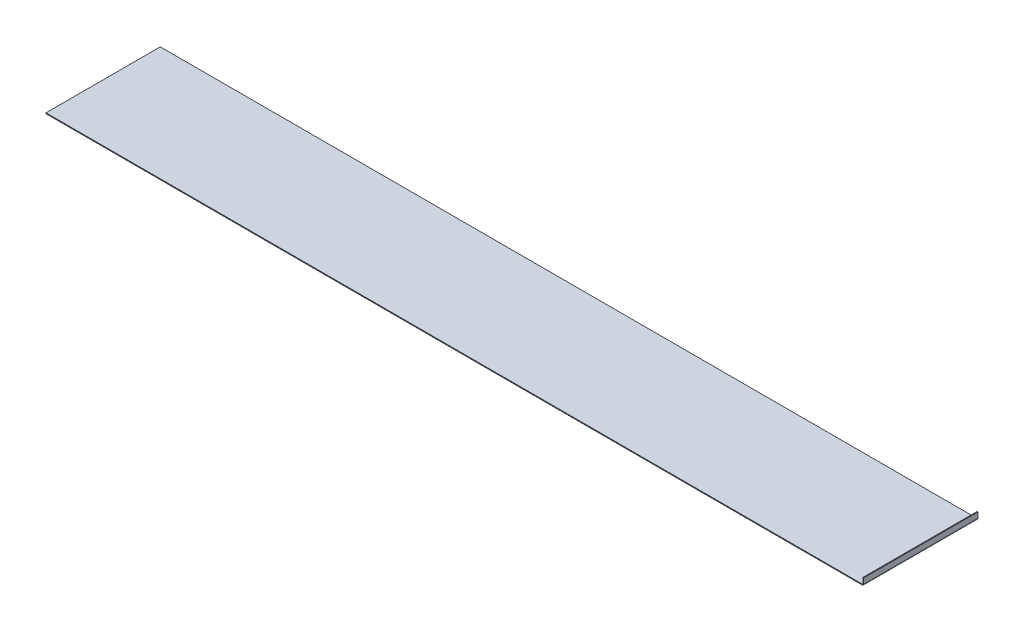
ISO-10303-21;
HEADER;
FILE_DESCRIPTION(('STEP AP214'),'2;1');
FILE_NAME('part.step','',(''),(''),'','','');
FILE_SCHEMA(('AUTOMOTIVE_DESIGN { 1 0 10303 214 1 1 1 1 }'));
ENDSEC;
DATA;
#1=APPLICATION_CONTEXT('core data for automotive mechanical design processes');
#2=APPLICATION_PROTOCOL_DEFINITION('international standard','automotive_design',2000,#1);
#3=PRODUCT_CONTEXT('',#1,'mechanical');
#4=PRODUCT('Part','Part','',(#3));
#5=PRODUCT_RELATED_PRODUCT_CATEGORY('part','',(#4));
#6=PRODUCT_DEFINITION_FORMATION('','',#4);
#7=PRODUCT_DEFINITION_CONTEXT('part definition',#1,'design');
#8=PRODUCT_DEFINITION('design','',#6,#7);
#9=PRODUCT_DEFINITION_SHAPE('','',#8);
#10=(LENGTH_UNIT() NAMED_UNIT(*) SI_UNIT(.MILLI.,.METRE.));
#11=(NAMED_UNIT(*) PLANE_ANGLE_UNIT() SI_UNIT($,.RADIAN.));
#12=(NAMED_UNIT(*) SI_UNIT($,.STERADIAN.) SOLID_ANGLE_UNIT());
#13=UNCERTAINTY_MEASURE_WITH_UNIT(LENGTH_MEASURE(1.E-05),#10,'distance_accuracy_value','');
#14=(GEOMETRIC_REPRESENTATION_CONTEXT(3) GLOBAL_UNCERTAINTY_ASSIGNED_CONTEXT((#13)) GLOBAL_UNIT_ASSIGNED_CONTEXT((#10,
#11,#12)) REPRESENTATION_CONTEXT('',''));
#15=CARTESIAN_POINT('',(0.,0.,0.));
#16=DIRECTION('',(0.,0.,1.));
#17=DIRECTION('',(1.,0.,0.));
#18=AXIS2_PLACEMENT_3D('',#15,#16,#17);
#19=CARTESIAN_POINT('',(-1000.,2.,-140.));
#20=DIRECTION('',(-1.,0.,0.));
#21=DIRECTION('',(0.,0.,1.));
#22=AXIS2_PLACEMENT_3D('',#19,#20,#21);
#23=PLANE('',#22);
#24=DIRECTION('',(0.,1.,0.));
#25=VECTOR('',#24,1.);
#26=CARTESIAN_POINT('',(-1000.,2.,-140.));
#27=LINE('',#26,#25);
#28=CARTESIAN_POINT('',(-1000.,0.,-140.));
#29=VERTEX_POINT('',#28);
#30=CARTESIAN_POINT('',(-1000.,2.,-140.));
#31=VERTEX_POINT('',#30);
#32=EDGE_CURVE('E13',#29,#31,#27,.T.);
#33=ORIENTED_EDGE('',*,*,#32,.F.);
#34=DIRECTION('',(0.,0.,1.));
#35=VECTOR('',#34,1.);
#36=CARTESIAN_POINT('',(-1000.,0.,140.));
#37=LINE('',#36,#35);
#38=CARTESIAN_POINT('',(-1000.,0.,140.));
#39=VERTEX_POINT('',#38);
#40=EDGE_CURVE('E132',#29,#39,#37,.T.);
#41=ORIENTED_EDGE('',*,*,#40,.T.);
#42=DIRECTION('',(0.,1.,0.));
#43=VECTOR('',#42,1.);
#44=CARTESIAN_POINT('',(-1000.,2.,140.));
#45=LINE('',#44,#43);
#46=CARTESIAN_POINT('',(-1000.,2.,140.));
#47=VERTEX_POINT('',#46);
#48=EDGE_CURVE('E64',#39,#47,#45,.T.);
#49=ORIENTED_EDGE('',*,*,#48,.T.);
#50=DIRECTION('',(0.,0.,1.));
#51=VECTOR('',#50,1.);
#52=CARTESIAN_POINT('',(-1000.,2.,-140.));
#53=LINE('',#52,#51);
#54=EDGE_CURVE('E117',#31,#47,#53,.T.);
#55=ORIENTED_EDGE('',*,*,#54,.F.);
#56=EDGE_LOOP('',(#33,#41,#49,#55));
#57=FACE_BOUND('',#56,.T.);
#58=ADVANCED_FACE('F54',(#57),#23,.T.);
#59=CARTESIAN_POINT('',(-1000.,2.,140.));
#60=DIRECTION('',(0.,0.,1.));
#61=DIRECTION('',(1.,0.,0.));
#62=AXIS2_PLACEMENT_3D('',#59,#60,#61);
#63=PLANE('',#62);
#64=ORIENTED_EDGE('',*,*,#48,.F.);
#65=DIRECTION('',(1.,0.,0.));
#66=VECTOR('',#65,1.);
#67=CARTESIAN_POINT('',(1000.,0.,140.));
#68=LINE('',#67,#66);
#69=CARTESIAN_POINT('',(1000.,0.,140.));
#70=VERTEX_POINT('',#69);
#71=EDGE_CURVE('E130',#39,#70,#68,.T.);
#72=ORIENTED_EDGE('',*,*,#71,.T.);
#73=DIRECTION('',(0.,1.,0.));
#74=VECTOR('',#73,1.);
#75=CARTESIAN_POINT('',(1000.,2.,140.));
#76=LINE('',#75,#74);
#77=CARTESIAN_POINT('',(1000.,2.,140.));
#78=VERTEX_POINT('',#77);
#79=EDGE_CURVE('E72',#70,#78,#76,.T.);
#80=ORIENTED_EDGE('',*,*,#79,.T.);
#81=DIRECTION('',(1.,0.,0.));
#82=VECTOR('',#81,1.);
#83=CARTESIAN_POINT('',(-1000.,2.,140.));
#84=LINE('',#83,#82);
#85=EDGE_CURVE('E121',#47,#78,#84,.T.);
#86=ORIENTED_EDGE('',*,*,#85,.F.);
#87=EDGE_LOOP('',(#64,#72,#80,#86));
#88=FACE_BOUND('',#87,.T.);
#89=ADVANCED_FACE('F222',(#88),#63,.T.);
#90=CARTESIAN_POINT('',(-1000.,2.,-140.));
#91=DIRECTION('',(0.,0.,-1.));
#92=DIRECTION('',(-1.,0.,0.));
#93=AXIS2_PLACEMENT_3D('',#90,#91,#92);
#94=PLANE('',#93);
#95=DIRECTION('',(1.,0.,0.));
#96=VECTOR('',#95,1.);
#97=CARTESIAN_POINT('',(1000.,0.,-140.));
#98=LINE('',#97,#96);
#99=CARTESIAN_POINT('',(1000.,0.,-140.));
#100=VERTEX_POINT('',#99);
#101=EDGE_CURVE('E95',#100,#29,#98,.F.);
#102=ORIENTED_EDGE('',*,*,#101,.T.);
#103=ORIENTED_EDGE('',*,*,#32,.T.);
#104=DIRECTION('',(-1.,0.,0.));
#105=VECTOR('',#104,1.);
#106=CARTESIAN_POINT('',(-1000.,2.,-140.));
#107=LINE('',#106,#105);
#108=CARTESIAN_POINT('',(1000.,2.,-140.));
#109=VERTEX_POINT('',#108);
#110=EDGE_CURVE('E112',#109,#31,#107,.T.);
#111=ORIENTED_EDGE('',*,*,#110,.F.);
#112=DIRECTION('',(0.,1.,0.));
#113=VECTOR('',#112,1.);
#114=CARTESIAN_POINT('',(1000.,2.,-140.));
#115=LINE('',#114,#113);
#116=EDGE_CURVE('E58',#100,#109,#115,.T.);
#117=ORIENTED_EDGE('',*,*,#116,.F.);
#118=EDGE_LOOP('',(#102,#103,#111,#117));
#119=FACE_BOUND('',#118,.T.);
#120=ADVANCED_FACE('F56',(#119),#94,.T.);
#121=CARTESIAN_POINT('',(1000.,2.,140.));
#122=DIRECTION('',(0.,1.,0.));
#123=DIRECTION('',(0.,0.,1.));
#124=AXIS2_PLACEMENT_3D('',#121,#122,#123);
#125=PLANE('',#124);
#126=DIRECTION('',(0.,0.,-1.));
#127=VECTOR('',#126,1.);
#128=CARTESIAN_POINT('',(1000.,2.,-140.));
#129=LINE('',#128,#127);
#130=EDGE_CURVE('E119',#78,#109,#129,.T.);
#131=ORIENTED_EDGE('',*,*,#130,.T.);
#132=ORIENTED_EDGE('',*,*,#110,.T.);
#133=ORIENTED_EDGE('',*,*,#54,.T.);
#134=ORIENTED_EDGE('',*,*,#85,.T.);
#135=EDGE_LOOP('',(#131,#132,#133,#134));
#136=FACE_BOUND('',#135,.T.);
#137=ADVANCED_FACE('F116',(#136),#125,.T.);
#138=CARTESIAN_POINT('',(1000.,0.,140.));
#139=DIRECTION('',(0.,1.,0.));
#140=DIRECTION('',(0.,0.,1.));
#141=AXIS2_PLACEMENT_3D('',#138,#139,#140);
#142=PLANE('',#141);
#143=DIRECTION('',(0.,0.,1.));
#144=VECTOR('',#143,1.);
#145=CARTESIAN_POINT('',(1000.,0.,140.));
#146=LINE('',#145,#144);
#147=EDGE_CURVE('E126',#70,#100,#146,.F.);
#148=ORIENTED_EDGE('',*,*,#147,.F.);
#149=ORIENTED_EDGE('',*,*,#71,.F.);
#150=ORIENTED_EDGE('',*,*,#40,.F.);
#151=ORIENTED_EDGE('',*,*,#101,.F.);
#152=EDGE_LOOP('',(#148,#149,#150,#151));
#153=FACE_BOUND('',#152,.T.);
#154=ADVANCED_FACE('F221',(#153),#142,.F.);
#155=CARTESIAN_POINT('',(1000.,4.,140.));
#156=DIRECTION('',(0.,0.,1.));
#157=DIRECTION('',(1.,0.,0.));
#158=AXIS2_PLACEMENT_3D('',#155,#156,#157);
#159=PLANE('',#158);
#160=DIRECTION('',(-1.,0.,0.));
#161=VECTOR('',#160,1.);
#162=CARTESIAN_POINT('',(1004.,4.,140.));
#163=LINE('',#162,#161);
#164=CARTESIAN_POINT('',(1002.,4.,140.));
#165=VERTEX_POINT('',#164);
#166=CARTESIAN_POINT('',(1004.,4.,140.));
#167=VERTEX_POINT('',#166);
#168=EDGE_CURVE('E163',#165,#167,#163,.F.);
#169=ORIENTED_EDGE('',*,*,#168,.F.);
#170=CARTESIAN_POINT('',(1000.,4.,140.));
#171=DIRECTION('',(0.,0.,-1.));
#172=DIRECTION('',(-1.,0.,0.));
#173=AXIS2_PLACEMENT_3D('',#170,#171,#172);
#174=CIRCLE('',#173,2.);
#175=EDGE_CURVE('E152',#78,#165,#174,.F.);
#176=ORIENTED_EDGE('',*,*,#175,.F.);
#177=ORIENTED_EDGE('',*,*,#79,.F.);
#178=CARTESIAN_POINT('',(1000.,4.,140.));
#179=DIRECTION('',(0.,0.,-1.));
#180=DIRECTION('',(-1.,0.,0.));
#181=AXIS2_PLACEMENT_3D('',#178,#179,#180);
#182=CIRCLE('',#181,4.);
#183=EDGE_CURVE('E129',#70,#167,#182,.F.);
#184=ORIENTED_EDGE('',*,*,#183,.T.);
#185=EDGE_LOOP('',(#169,#176,#177,#184));
#186=FACE_BOUND('',#185,.T.);
#187=ADVANCED_FACE('F224',(#186),#159,.T.);
#188=CARTESIAN_POINT('',(1000.,4.,-140.));
#189=DIRECTION('',(0.,0.,1.));
#190=DIRECTION('',(1.,0.,0.));
#191=AXIS2_PLACEMENT_3D('',#188,#189,#190);
#192=PLANE('',#191);
#193=CARTESIAN_POINT('',(1000.,4.,-140.));
#194=DIRECTION('',(0.,0.,-1.));
#195=DIRECTION('',(-1.,0.,0.));
#196=AXIS2_PLACEMENT_3D('',#193,#194,#195);
#197=CIRCLE('',#196,2.);
#198=CARTESIAN_POINT('',(1002.,4.,-140.));
#199=VERTEX_POINT('',#198);
#200=EDGE_CURVE('E142',#199,#109,#197,.T.);
#201=ORIENTED_EDGE('',*,*,#200,.F.);
#202=DIRECTION('',(-1.,0.,0.));
#203=VECTOR('',#202,1.);
#204=CARTESIAN_POINT('',(1002.,4.,-140.));
#205=LINE('',#204,#203);
#206=CARTESIAN_POINT('',(1004.,4.,-140.));
#207=VERTEX_POINT('',#206);
#208=EDGE_CURVE('E167',#199,#207,#205,.F.);
#209=ORIENTED_EDGE('',*,*,#208,.T.);
#210=CARTESIAN_POINT('',(1000.,4.,-140.));
#211=DIRECTION('',(0.,0.,-1.));
#212=DIRECTION('',(-1.,0.,0.));
#213=AXIS2_PLACEMENT_3D('',#210,#211,#212);
#214=CIRCLE('',#213,4.);
#215=EDGE_CURVE('E145',#207,#100,#214,.T.);
#216=ORIENTED_EDGE('',*,*,#215,.T.);
#217=ORIENTED_EDGE('',*,*,#116,.T.);
#218=EDGE_LOOP('',(#201,#209,#216,#217));
#219=FACE_BOUND('',#218,.T.);
#220=ADVANCED_FACE('F140',(#219),#192,.F.);
#221=CARTESIAN_POINT('',(1000.,4.,-140.));
#222=DIRECTION('',(0.,0.,-1.));
#223=DIRECTION('',(1.,0.,0.));
#224=AXIS2_PLACEMENT_3D('',#221,#222,#223);
#225=CYLINDRICAL_SURFACE('',#224,4.);
#226=ORIENTED_EDGE('',*,*,#147,.T.);
#227=ORIENTED_EDGE('',*,*,#215,.F.);
#228=DIRECTION('',(0.,0.,-1.));
#229=VECTOR('',#228,1.);
#230=CARTESIAN_POINT('',(1004.,4.,140.));
#231=LINE('',#230,#229);
#232=EDGE_CURVE('E169',#207,#167,#231,.F.);
#233=ORIENTED_EDGE('',*,*,#232,.T.);
#234=ORIENTED_EDGE('',*,*,#183,.F.);
#235=EDGE_LOOP('',(#226,#227,#233,#234));
#236=FACE_BOUND('',#235,.T.);
#237=ADVANCED_FACE('F218',(#236),#225,.T.);
#238=CARTESIAN_POINT('',(1000.,4.,-140.));
#239=DIRECTION('',(0.,0.,-1.));
#240=DIRECTION('',(1.,0.,0.));
#241=AXIS2_PLACEMENT_3D('',#238,#239,#240);
#242=CYLINDRICAL_SURFACE('',#241,2.);
#243=ORIENTED_EDGE('',*,*,#130,.F.);
#244=ORIENTED_EDGE('',*,*,#175,.T.);
#245=DIRECTION('',(0.,0.,-1.));
#246=VECTOR('',#245,1.);
#247=CARTESIAN_POINT('',(1002.,4.,140.));
#248=LINE('',#247,#246);
#249=EDGE_CURVE('E151',#165,#199,#248,.T.);
#250=ORIENTED_EDGE('',*,*,#249,.T.);
#251=ORIENTED_EDGE('',*,*,#200,.T.);
#252=EDGE_LOOP('',(#243,#244,#250,#251));
#253=FACE_BOUND('',#252,.T.);
#254=ADVANCED_FACE('F147',(#253),#242,.F.);
#255=CARTESIAN_POINT('',(1004.,1.99999999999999,140.));
#256=DIRECTION('',(0.,0.,-1.));
#257=DIRECTION('',(-1.,0.,0.));
#258=AXIS2_PLACEMENT_3D('',#255,#256,#257);
#259=PLANE('',#258);
#260=ORIENTED_EDGE('',*,*,#168,.T.);
#261=DIRECTION('',(0.,-1.,0.));
#262=VECTOR('',#261,1.);
#263=CARTESIAN_POINT('',(1004.,17.,140.));
#264=LINE('',#263,#262);
#265=CARTESIAN_POINT('',(1004.,17.,140.));
#266=VERTEX_POINT('',#265);
#267=EDGE_CURVE('E180',#266,#167,#264,.T.);
#268=ORIENTED_EDGE('',*,*,#267,.F.);
#269=DIRECTION('',(-1.,0.,0.));
#270=VECTOR('',#269,1.);
#271=CARTESIAN_POINT('',(1004.,17.,140.));
#272=LINE('',#271,#270);
#273=CARTESIAN_POINT('',(1002.,17.,140.));
#274=VERTEX_POINT('',#273);
#275=EDGE_CURVE('E157',#266,#274,#272,.T.);
#276=ORIENTED_EDGE('',*,*,#275,.T.);
#277=DIRECTION('',(0.,1.,0.));
#278=VECTOR('',#277,1.);
#279=CARTESIAN_POINT('',(1002.,1.99999999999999,140.));
#280=LINE('',#279,#278);
#281=EDGE_CURVE('E171',#274,#165,#280,.F.);
#282=ORIENTED_EDGE('',*,*,#281,.T.);
#283=EDGE_LOOP('',(#260,#268,#276,#282));
#284=FACE_BOUND('',#283,.T.);
#285=ADVANCED_FACE('F195',(#284),#259,.F.);
#286=CARTESIAN_POINT('',(1004.,17.,-140.));
#287=DIRECTION('',(0.,0.,1.));
#288=DIRECTION('',(1.,0.,0.));
#289=AXIS2_PLACEMENT_3D('',#286,#287,#288);
#290=PLANE('',#289);
#291=ORIENTED_EDGE('',*,*,#208,.F.);
#292=DIRECTION('',(0.,-1.,0.));
#293=VECTOR('',#292,1.);
#294=CARTESIAN_POINT('',(1002.,17.,-140.));
#295=LINE('',#294,#293);
#296=CARTESIAN_POINT('',(1002.,17.,-140.));
#297=VERTEX_POINT('',#296);
#298=EDGE_CURVE('E174',#199,#297,#295,.F.);
#299=ORIENTED_EDGE('',*,*,#298,.T.);
#300=DIRECTION('',(-1.,0.,0.));
#301=VECTOR('',#300,1.);
#302=CARTESIAN_POINT('',(1004.,17.,-140.));
#303=LINE('',#302,#301);
#304=CARTESIAN_POINT('',(1004.,17.,-140.));
#305=VERTEX_POINT('',#304);
#306=EDGE_CURVE('E153',#305,#297,#303,.T.);
#307=ORIENTED_EDGE('',*,*,#306,.F.);
#308=DIRECTION('',(0.,1.,0.));
#309=VECTOR('',#308,1.);
#310=CARTESIAN_POINT('',(1004.,17.,-140.));
#311=LINE('',#310,#309);
#312=EDGE_CURVE('E183',#207,#305,#311,.T.);
#313=ORIENTED_EDGE('',*,*,#312,.F.);
#314=EDGE_LOOP('',(#291,#299,#307,#313));
#315=FACE_BOUND('',#314,.T.);
#316=ADVANCED_FACE('F207',(#315),#290,.F.);
#317=CARTESIAN_POINT('',(1004.,17.,140.));
#318=DIRECTION('',(-1.,0.,0.));
#319=DIRECTION('',(0.,0.,1.));
#320=AXIS2_PLACEMENT_3D('',#317,#318,#319);
#321=PLANE('',#320);
#322=ORIENTED_EDGE('',*,*,#232,.F.);
#323=ORIENTED_EDGE('',*,*,#312,.T.);
#324=DIRECTION('',(0.,0.,1.));
#325=VECTOR('',#324,1.);
#326=CARTESIAN_POINT('',(1004.,17.,140.));
#327=LINE('',#326,#325);
#328=EDGE_CURVE('E186',#305,#266,#327,.T.);
#329=ORIENTED_EDGE('',*,*,#328,.T.);
#330=ORIENTED_EDGE('',*,*,#267,.T.);
#331=EDGE_LOOP('',(#322,#323,#329,#330));
#332=FACE_BOUND('',#331,.T.);
#333=ADVANCED_FACE('F215',(#332),#321,.F.);
#334=CARTESIAN_POINT('',(1002.,17.,140.));
#335=DIRECTION('',(-1.,0.,0.));
#336=DIRECTION('',(0.,0.,1.));
#337=AXIS2_PLACEMENT_3D('',#334,#335,#336);
#338=PLANE('',#337);
#339=ORIENTED_EDGE('',*,*,#298,.F.);
#340=ORIENTED_EDGE('',*,*,#249,.F.);
#341=ORIENTED_EDGE('',*,*,#281,.F.);
#342=DIRECTION('',(0.,0.,-1.));
#343=VECTOR('',#342,1.);
#344=CARTESIAN_POINT('',(1002.,17.,140.));
#345=LINE('',#344,#343);
#346=EDGE_CURVE('E177',#297,#274,#345,.F.);
#347=ORIENTED_EDGE('',*,*,#346,.F.);
#348=EDGE_LOOP('',(#339,#340,#341,#347));
#349=FACE_BOUND('',#348,.T.);
#350=ADVANCED_FACE('F204',(#349),#338,.T.);
#351=CARTESIAN_POINT('',(1004.,17.,140.));
#352=DIRECTION('',(0.,-1.,0.));
#353=DIRECTION('',(1.,0.,0.));
#354=AXIS2_PLACEMENT_3D('',#351,#352,#353);
#355=PLANE('',#354);
#356=ORIENTED_EDGE('',*,*,#346,.T.);
#357=ORIENTED_EDGE('',*,*,#275,.F.);
#358=ORIENTED_EDGE('',*,*,#328,.F.);
#359=ORIENTED_EDGE('',*,*,#306,.T.);
#360=EDGE_LOOP('',(#356,#357,#358,#359));
#361=FACE_BOUND('',#360,.T.);
#362=ADVANCED_FACE('F211',(#361),#355,.F.);
#363=CLOSED_SHELL('',(#58,#89,#120,#137,#154,#187,#220,#237,#254,#285,#316,#333,#350,#362));
#364=MANIFOLD_SOLID_BREP('B2',#363);
#365=ADVANCED_BREP_SHAPE_REPRESENTATION('',(#18,#364),#14);
#366=SHAPE_DEFINITION_REPRESENTATION(#9,#365);
ENDSEC;
END-ISO-10303-21;
